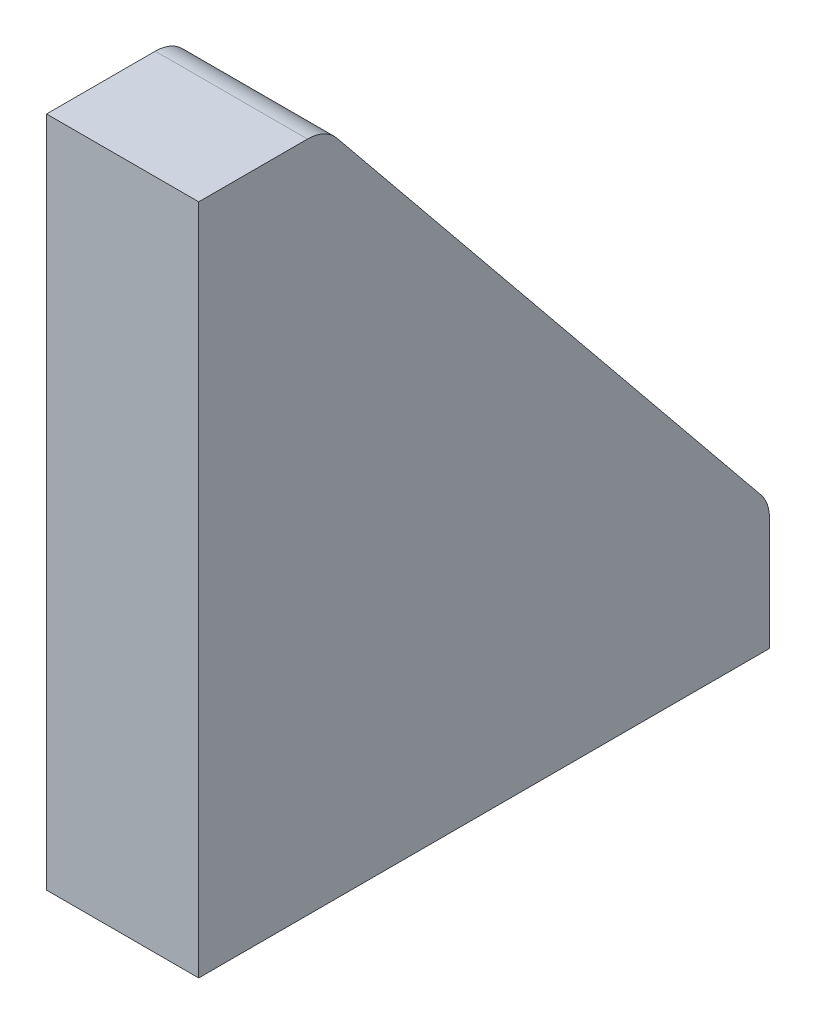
ISO-10303-21;
HEADER;
FILE_DESCRIPTION(('STEP AP214'),'2;1');
FILE_NAME('part.step','',(''),(''),'','','');
FILE_SCHEMA(('AUTOMOTIVE_DESIGN { 1 0 10303 214 1 1 1 1 }'));
ENDSEC;
DATA;
#1=APPLICATION_CONTEXT('core data for automotive mechanical design processes');
#2=APPLICATION_PROTOCOL_DEFINITION('international standard','automotive_design',2000,#1);
#3=PRODUCT_CONTEXT('',#1,'mechanical');
#4=PRODUCT('Part','Part','',(#3));
#5=PRODUCT_RELATED_PRODUCT_CATEGORY('part','',(#4));
#6=PRODUCT_DEFINITION_FORMATION('','',#4);
#7=PRODUCT_DEFINITION_CONTEXT('part definition',#1,'design');
#8=PRODUCT_DEFINITION('design','',#6,#7);
#9=PRODUCT_DEFINITION_SHAPE('','',#8);
#10=(LENGTH_UNIT() NAMED_UNIT(*) SI_UNIT(.MILLI.,.METRE.));
#11=(NAMED_UNIT(*) PLANE_ANGLE_UNIT() SI_UNIT($,.RADIAN.));
#12=(NAMED_UNIT(*) SI_UNIT($,.STERADIAN.) SOLID_ANGLE_UNIT());
#13=UNCERTAINTY_MEASURE_WITH_UNIT(LENGTH_MEASURE(1.E-05),#10,'distance_accuracy_value','');
#14=(GEOMETRIC_REPRESENTATION_CONTEXT(3) GLOBAL_UNCERTAINTY_ASSIGNED_CONTEXT((#13)) GLOBAL_UNIT_ASSIGNED_CONTEXT((#10,
#11,#12)) REPRESENTATION_CONTEXT('',''));
#15=CARTESIAN_POINT('',(0.,0.,0.));
#16=DIRECTION('',(0.,0.,1.));
#17=DIRECTION('',(1.,0.,0.));
#18=AXIS2_PLACEMENT_3D('',#15,#16,#17);
#19=CARTESIAN_POINT('',(12.,8.93340013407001,-45.));
#20=DIRECTION('',(0.,0.,1.));
#21=DIRECTION('',(1.,0.,0.));
#22=AXIS2_PLACEMENT_3D('',#19,#20,#21);
#23=PLANE('',#22);
#24=DIRECTION('',(0.,1.,0.));
#25=VECTOR('',#24,1.);
#26=CARTESIAN_POINT('',(0.,8.93340013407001,-45.));
#27=LINE('',#26,#25);
#28=CARTESIAN_POINT('',(0.,0.,-45.));
#29=VERTEX_POINT('',#28);
#30=CARTESIAN_POINT('',(0.,8.93340013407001,-45.));
#31=VERTEX_POINT('',#30);
#32=EDGE_CURVE('E123',#29,#31,#27,.T.);
#33=ORIENTED_EDGE('',*,*,#32,.T.);
#34=DIRECTION('',(-1.,0.,0.));
#35=VECTOR('',#34,1.);
#36=CARTESIAN_POINT('',(12.,8.93340013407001,-45.));
#37=LINE('',#36,#35);
#38=CARTESIAN_POINT('',(12.,8.93340013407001,-45.));
#39=VERTEX_POINT('',#38);
#40=EDGE_CURVE('E11',#39,#31,#37,.T.);
#41=ORIENTED_EDGE('',*,*,#40,.F.);
#42=DIRECTION('',(0.,1.,0.));
#43=VECTOR('',#42,1.);
#44=CARTESIAN_POINT('',(12.,8.93340013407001,-45.));
#45=LINE('',#44,#43);
#46=CARTESIAN_POINT('',(12.,0.,-45.));
#47=VERTEX_POINT('',#46);
#48=EDGE_CURVE('E135',#47,#39,#45,.T.);
#49=ORIENTED_EDGE('',*,*,#48,.F.);
#50=DIRECTION('',(-1.,0.,0.));
#51=VECTOR('',#50,1.);
#52=CARTESIAN_POINT('',(12.,0.,-45.));
#53=LINE('',#52,#51);
#54=EDGE_CURVE('E119',#47,#29,#53,.T.);
#55=ORIENTED_EDGE('',*,*,#54,.T.);
#56=EDGE_LOOP('',(#33,#41,#49,#55));
#57=FACE_BOUND('',#56,.T.);
#58=ADVANCED_FACE('F33',(#57),#23,.F.);
#59=CARTESIAN_POINT('',(12.,8.93340013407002,-42.));
#60=DIRECTION('',(-1.,0.,0.));
#61=DIRECTION('',(0.,0.,1.));
#62=AXIS2_PLACEMENT_3D('',#59,#60,#61);
#63=CYLINDRICAL_SURFACE('',#62,3.);
#64=CARTESIAN_POINT('',(0.,8.93340013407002,-42.));
#65=DIRECTION('',(1.,0.,0.));
#66=DIRECTION('',(0.,0.,1.));
#67=AXIS2_PLACEMENT_3D('',#64,#65,#66);
#68=CIRCLE('',#67,3.);
#69=CARTESIAN_POINT('',(0.,10.8272143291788,-44.3266860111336));
#70=VERTEX_POINT('',#69);
#71=EDGE_CURVE('E126',#31,#70,#68,.T.);
#72=ORIENTED_EDGE('',*,*,#71,.T.);
#73=DIRECTION('',(-1.,0.,0.));
#74=VECTOR('',#73,1.);
#75=CARTESIAN_POINT('',(12.,10.8272143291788,-44.3266860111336));
#76=LINE('',#75,#74);
#77=CARTESIAN_POINT('',(12.,10.8272143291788,-44.3266860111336));
#78=VERTEX_POINT('',#77);
#79=EDGE_CURVE('E41',#78,#70,#76,.T.);
#80=ORIENTED_EDGE('',*,*,#79,.F.);
#81=CARTESIAN_POINT('',(12.,8.93340013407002,-42.));
#82=DIRECTION('',(1.,0.,0.));
#83=DIRECTION('',(0.,0.,1.));
#84=AXIS2_PLACEMENT_3D('',#81,#82,#83);
#85=CIRCLE('',#84,3.);
#86=EDGE_CURVE('E89',#39,#78,#85,.T.);
#87=ORIENTED_EDGE('',*,*,#86,.F.);
#88=ORIENTED_EDGE('',*,*,#40,.T.);
#89=EDGE_LOOP('',(#72,#80,#87,#88));
#90=FACE_BOUND('',#89,.T.);
#91=ADVANCED_FACE('F160',(#90),#63,.T.);
#92=CARTESIAN_POINT('',(12.,51.8938141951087,-10.9003837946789));
#93=DIRECTION('',(0.,-0.631271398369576,0.775562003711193));
#94=DIRECTION('',(0.,-0.775562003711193,-0.631271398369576));
#95=AXIS2_PLACEMENT_3D('',#92,#93,#94);
#96=PLANE('',#95);
#97=DIRECTION('',(0.,0.775562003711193,0.631271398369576));
#98=VECTOR('',#97,1.);
#99=CARTESIAN_POINT('',(0.,51.8938141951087,-10.9003837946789));
#100=LINE('',#99,#98);
#101=CARTESIAN_POINT('',(0.,51.8938141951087,-10.9003837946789));
#102=VERTEX_POINT('',#101);
#103=EDGE_CURVE('E128',#70,#102,#100,.T.);
#104=ORIENTED_EDGE('',*,*,#103,.T.);
#105=DIRECTION('',(-1.,0.,0.));
#106=VECTOR('',#105,1.);
#107=CARTESIAN_POINT('',(12.,51.8938141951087,-10.9003837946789));
#108=LINE('',#107,#106);
#109=CARTESIAN_POINT('',(12.,51.8938141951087,-10.9003837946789));
#110=VERTEX_POINT('',#109);
#111=EDGE_CURVE('E139',#110,#102,#108,.T.);
#112=ORIENTED_EDGE('',*,*,#111,.F.);
#113=DIRECTION('',(0.,0.775562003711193,0.631271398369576));
#114=VECTOR('',#113,1.);
#115=CARTESIAN_POINT('',(12.,51.8938141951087,-10.9003837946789));
#116=LINE('',#115,#114);
#117=EDGE_CURVE('E147',#78,#110,#116,.T.);
#118=ORIENTED_EDGE('',*,*,#117,.F.);
#119=ORIENTED_EDGE('',*,*,#79,.T.);
#120=EDGE_LOOP('',(#104,#112,#118,#119));
#121=FACE_BOUND('',#120,.T.);
#122=ADVANCED_FACE('F145',(#121),#96,.F.);
#123=CARTESIAN_POINT('',(12.,50.,-8.57369778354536));
#124=DIRECTION('',(-1.,0.,0.));
#125=DIRECTION('',(0.,0.,1.));
#126=AXIS2_PLACEMENT_3D('',#123,#124,#125);
#127=CYLINDRICAL_SURFACE('',#126,3.);
#128=CARTESIAN_POINT('',(0.,50.,-8.57369778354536));
#129=DIRECTION('',(1.,0.,0.));
#130=DIRECTION('',(0.,0.,1.));
#131=AXIS2_PLACEMENT_3D('',#128,#129,#130);
#132=CIRCLE('',#131,3.);
#133=CARTESIAN_POINT('',(0.,53.,-8.57369778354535));
#134=VERTEX_POINT('',#133);
#135=EDGE_CURVE('E130',#102,#134,#132,.T.);
#136=ORIENTED_EDGE('',*,*,#135,.T.);
#137=DIRECTION('',(-1.,0.,0.));
#138=VECTOR('',#137,1.);
#139=CARTESIAN_POINT('',(12.,53.,-8.57369778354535));
#140=LINE('',#139,#138);
#141=CARTESIAN_POINT('',(12.,53.,-8.57369778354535));
#142=VERTEX_POINT('',#141);
#143=EDGE_CURVE('E114',#142,#134,#140,.T.);
#144=ORIENTED_EDGE('',*,*,#143,.F.);
#145=CARTESIAN_POINT('',(12.,50.,-8.57369778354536));
#146=DIRECTION('',(1.,0.,0.));
#147=DIRECTION('',(0.,0.,1.));
#148=AXIS2_PLACEMENT_3D('',#145,#146,#147);
#149=CIRCLE('',#148,3.);
#150=EDGE_CURVE('E105',#110,#142,#149,.T.);
#151=ORIENTED_EDGE('',*,*,#150,.F.);
#152=ORIENTED_EDGE('',*,*,#111,.T.);
#153=EDGE_LOOP('',(#136,#144,#151,#152));
#154=FACE_BOUND('',#153,.T.);
#155=ADVANCED_FACE('F153',(#154),#127,.T.);
#156=CARTESIAN_POINT('',(12.,53.,0.));
#157=DIRECTION('',(0.,-1.,0.));
#158=DIRECTION('',(0.,0.,-1.));
#159=AXIS2_PLACEMENT_3D('',#156,#157,#158);
#160=PLANE('',#159);
#161=DIRECTION('',(0.,0.,1.));
#162=VECTOR('',#161,1.);
#163=CARTESIAN_POINT('',(0.,53.,0.));
#164=LINE('',#163,#162);
#165=CARTESIAN_POINT('',(0.,53.,0.));
#166=VERTEX_POINT('',#165);
#167=EDGE_CURVE('E113',#134,#166,#164,.T.);
#168=ORIENTED_EDGE('',*,*,#167,.T.);
#169=DIRECTION('',(-1.,0.,0.));
#170=VECTOR('',#169,1.);
#171=CARTESIAN_POINT('',(12.,53.,0.));
#172=LINE('',#171,#170);
#173=CARTESIAN_POINT('',(12.,53.,0.));
#174=VERTEX_POINT('',#173);
#175=EDGE_CURVE('E110',#174,#166,#172,.T.);
#176=ORIENTED_EDGE('',*,*,#175,.F.);
#177=DIRECTION('',(0.,0.,1.));
#178=VECTOR('',#177,1.);
#179=CARTESIAN_POINT('',(12.,53.,0.));
#180=LINE('',#179,#178);
#181=EDGE_CURVE('E99',#142,#174,#180,.T.);
#182=ORIENTED_EDGE('',*,*,#181,.F.);
#183=ORIENTED_EDGE('',*,*,#143,.T.);
#184=EDGE_LOOP('',(#168,#176,#182,#183));
#185=FACE_BOUND('',#184,.T.);
#186=ADVANCED_FACE('F111',(#185),#160,.F.);
#187=CARTESIAN_POINT('',(12.,0.,0.));
#188=DIRECTION('',(0.,0.,-1.));
#189=DIRECTION('',(-1.,0.,0.));
#190=AXIS2_PLACEMENT_3D('',#187,#188,#189);
#191=PLANE('',#190);
#192=DIRECTION('',(0.,-1.,0.));
#193=VECTOR('',#192,1.);
#194=CARTESIAN_POINT('',(0.,0.,0.));
#195=LINE('',#194,#193);
#196=CARTESIAN_POINT('',(0.,0.,0.));
#197=VERTEX_POINT('',#196);
#198=EDGE_CURVE('E75',#166,#197,#195,.T.);
#199=ORIENTED_EDGE('',*,*,#198,.T.);
#200=DIRECTION('',(-1.,0.,0.));
#201=VECTOR('',#200,1.);
#202=CARTESIAN_POINT('',(12.,0.,0.));
#203=LINE('',#202,#201);
#204=CARTESIAN_POINT('',(12.,0.,0.));
#205=VERTEX_POINT('',#204);
#206=EDGE_CURVE('E115',#205,#197,#203,.T.);
#207=ORIENTED_EDGE('',*,*,#206,.F.);
#208=DIRECTION('',(0.,-1.,0.));
#209=VECTOR('',#208,1.);
#210=CARTESIAN_POINT('',(12.,0.,0.));
#211=LINE('',#210,#209);
#212=EDGE_CURVE('E103',#174,#205,#211,.T.);
#213=ORIENTED_EDGE('',*,*,#212,.F.);
#214=ORIENTED_EDGE('',*,*,#175,.T.);
#215=EDGE_LOOP('',(#199,#207,#213,#214));
#216=FACE_BOUND('',#215,.T.);
#217=ADVANCED_FACE('F117',(#216),#191,.F.);
#218=CARTESIAN_POINT('',(12.,0.,-45.));
#219=DIRECTION('',(0.,1.,0.));
#220=DIRECTION('',(0.,0.,1.));
#221=AXIS2_PLACEMENT_3D('',#218,#219,#220);
#222=PLANE('',#221);
#223=DIRECTION('',(0.,0.,-1.));
#224=VECTOR('',#223,1.);
#225=CARTESIAN_POINT('',(0.,0.,-45.));
#226=LINE('',#225,#224);
#227=EDGE_CURVE('E81',#197,#29,#226,.T.);
#228=ORIENTED_EDGE('',*,*,#227,.T.);
#229=ORIENTED_EDGE('',*,*,#54,.F.);
#230=DIRECTION('',(0.,0.,-1.));
#231=VECTOR('',#230,1.);
#232=CARTESIAN_POINT('',(12.,0.,-45.));
#233=LINE('',#232,#231);
#234=EDGE_CURVE('E49',#205,#47,#233,.T.);
#235=ORIENTED_EDGE('',*,*,#234,.F.);
#236=ORIENTED_EDGE('',*,*,#206,.T.);
#237=EDGE_LOOP('',(#228,#229,#235,#236));
#238=FACE_BOUND('',#237,.T.);
#239=ADVANCED_FACE('F174',(#238),#222,.F.);
#240=CARTESIAN_POINT('',(12.,50.,-8.57369778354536));
#241=DIRECTION('',(-1.,0.,0.));
#242=DIRECTION('',(0.,0.,1.));
#243=AXIS2_PLACEMENT_3D('',#240,#241,#242);
#244=PLANE('',#243);
#245=ORIENTED_EDGE('',*,*,#48,.T.);
#246=ORIENTED_EDGE('',*,*,#86,.T.);
#247=ORIENTED_EDGE('',*,*,#117,.T.);
#248=ORIENTED_EDGE('',*,*,#150,.T.);
#249=ORIENTED_EDGE('',*,*,#181,.T.);
#250=ORIENTED_EDGE('',*,*,#212,.T.);
#251=ORIENTED_EDGE('',*,*,#234,.T.);
#252=EDGE_LOOP('',(#245,#246,#247,#248,#249,#250,#251));
#253=FACE_BOUND('',#252,.T.);
#254=ADVANCED_FACE('F101',(#253),#244,.F.);
#255=CARTESIAN_POINT('',(0.,50.,-8.57369778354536));
#256=DIRECTION('',(-1.,0.,0.));
#257=DIRECTION('',(0.,0.,1.));
#258=AXIS2_PLACEMENT_3D('',#255,#256,#257);
#259=PLANE('',#258);
#260=ORIENTED_EDGE('',*,*,#32,.F.);
#261=ORIENTED_EDGE('',*,*,#227,.F.);
#262=ORIENTED_EDGE('',*,*,#198,.F.);
#263=ORIENTED_EDGE('',*,*,#167,.F.);
#264=ORIENTED_EDGE('',*,*,#135,.F.);
#265=ORIENTED_EDGE('',*,*,#103,.F.);
#266=ORIENTED_EDGE('',*,*,#71,.F.);
#267=EDGE_LOOP('',(#260,#261,#262,#263,#264,#265,#266));
#268=FACE_BOUND('',#267,.T.);
#269=ADVANCED_FACE('F151',(#268),#259,.T.);
#270=CLOSED_SHELL('',(#58,#91,#122,#155,#186,#217,#239,#254,#269));
#271=MANIFOLD_SOLID_BREP('B2',#270);
#272=ADVANCED_BREP_SHAPE_REPRESENTATION('',(#18,#271),#14);
#273=SHAPE_DEFINITION_REPRESENTATION(#9,#272);
ENDSEC;
END-ISO-10303-21;
